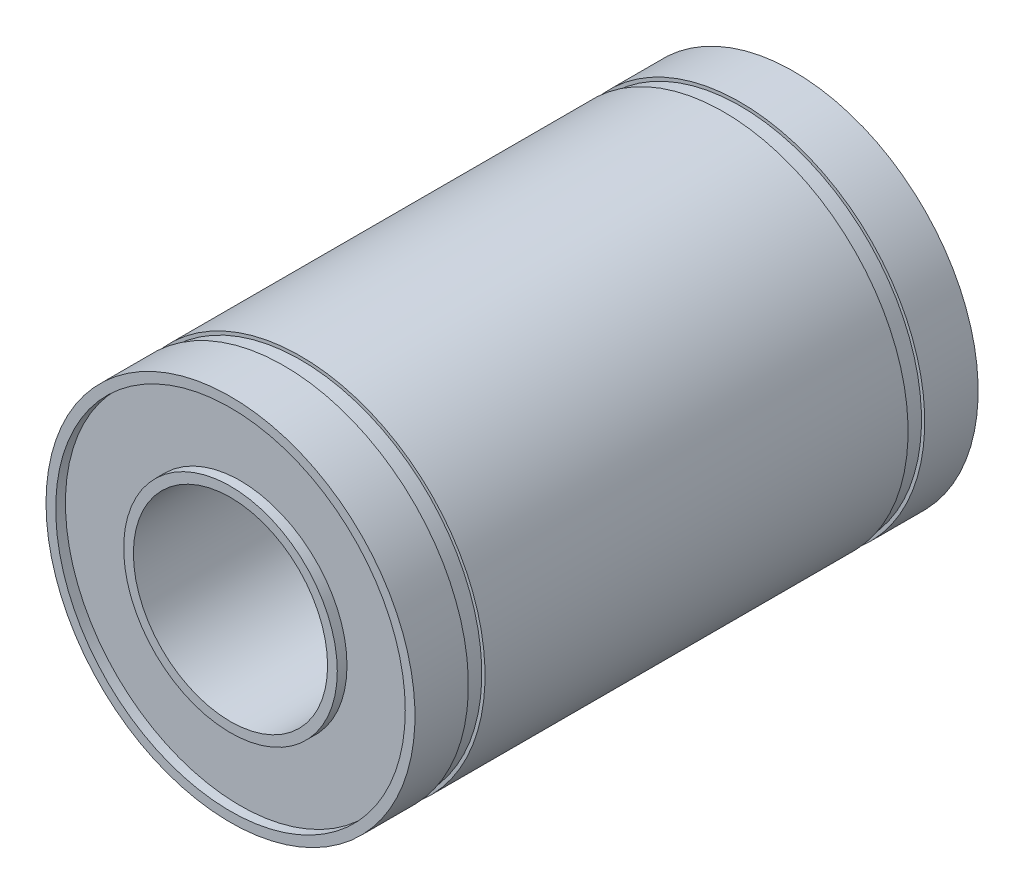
from build123d import *

# Parameters (mm, degrees)
SKETCH1_R           = 9.5
SKETCH1_R_2         = 5
BOSS_EXTRUDE1_DEPTH = 14.5
SKETCH2_W           = 0.167239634
SKETCH2_H           = 0.858355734
SKETCH3_R           = 9
SKETCH3_R_2         = 5.5
CUT_EXTRUDE1_DEPTH  = 0.5


with BuildPart() as part:
    # Sketch1 → Boss-Extrude1 (new, symmetric)
    with BuildSketch(Plane.XY):
        with Locations(Location((0, 0, 0), (0, 0, 180))):
            Circle(SKETCH1_R)
        with Locations(Location((0, 0, 0), (0, 0, 180))):
            Circle(SKETCH1_R_2, mode=Mode.SUBTRACT)
    extrude(amount=BOSS_EXTRUDE1_DEPTH, both=True)

    # Sketch2 → Cut-Revolve1 (revolve, cut)
    with BuildSketch(Plane(origin=(0, 0, 0), x_dir=(1, 0, 0), z_dir=(0, 1, 0)), mode=Mode.PRIVATE) as cut_revolve1_sk:
        with Locations((9.416380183, -11.320822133)):
            Rectangle(SKETCH2_W, SKETCH2_H)
        with Locations((9.416380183, 11.320822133)):
            Rectangle(SKETCH2_W, SKETCH2_H)
    revolve(cut_revolve1_sk.sketch.rotate(Axis((0, 0, 0), (0, 0, 1)), 180), axis=Axis((0, 0, 0), (0, 0, 1)), mode=Mode.SUBTRACT)

    # Sketch3 → Cut-Extrude1 (cut)
    with BuildSketch(Plane.XY.offset(14.5)):
        Circle(SKETCH3_R)
        Circle(SKETCH3_R_2, mode=Mode.SUBTRACT)
    cut_extrude1 = extrude(amount=-CUT_EXTRUDE1_DEPTH, mode=Mode.SUBTRACT)

    # Mirror1: Cut-Extrude1 across plane
    add(cut_extrude1.mirror(Plane.XY), mode=Mode.SUBTRACT)


solid = part.part
